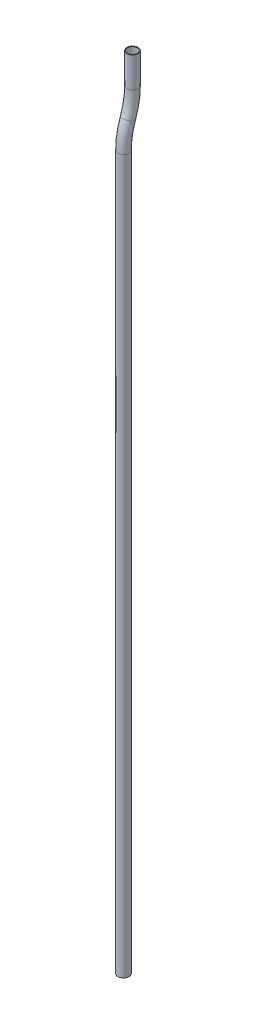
ISO-10303-21;
HEADER;
FILE_DESCRIPTION(('STEP AP214'),'2;1');
FILE_NAME('part.step','',(''),(''),'','','');
FILE_SCHEMA(('AUTOMOTIVE_DESIGN { 1 0 10303 214 1 1 1 1 }'));
ENDSEC;
DATA;
#1=APPLICATION_CONTEXT('core data for automotive mechanical design processes');
#2=APPLICATION_PROTOCOL_DEFINITION('international standard','automotive_design',2000,#1);
#3=PRODUCT_CONTEXT('',#1,'mechanical');
#4=PRODUCT('Part','Part','',(#3));
#5=PRODUCT_RELATED_PRODUCT_CATEGORY('part','',(#4));
#6=PRODUCT_DEFINITION_FORMATION('','',#4);
#7=PRODUCT_DEFINITION_CONTEXT('part definition',#1,'design');
#8=PRODUCT_DEFINITION('design','',#6,#7);
#9=PRODUCT_DEFINITION_SHAPE('','',#8);
#10=(LENGTH_UNIT() NAMED_UNIT(*) SI_UNIT(.MILLI.,.METRE.));
#11=(NAMED_UNIT(*) PLANE_ANGLE_UNIT() SI_UNIT($,.RADIAN.));
#12=(NAMED_UNIT(*) SI_UNIT($,.STERADIAN.) SOLID_ANGLE_UNIT());
#13=UNCERTAINTY_MEASURE_WITH_UNIT(LENGTH_MEASURE(1.E-05),#10,'distance_accuracy_value','');
#14=(GEOMETRIC_REPRESENTATION_CONTEXT(3) GLOBAL_UNCERTAINTY_ASSIGNED_CONTEXT((#13)) GLOBAL_UNIT_ASSIGNED_CONTEXT((#10,
#11,#12)) REPRESENTATION_CONTEXT('',''));
#15=CARTESIAN_POINT('',(0.,0.,0.));
#16=DIRECTION('',(0.,0.,1.));
#17=DIRECTION('',(1.,0.,0.));
#18=AXIS2_PLACEMENT_3D('',#15,#16,#17);
#19=CARTESIAN_POINT('',(0.,-54.6,-7.5));
#20=DIRECTION('',(0.,1.,0.));
#21=DIRECTION('',(0.,0.,1.));
#22=AXIS2_PLACEMENT_3D('',#19,#20,#21);
#23=CYLINDRICAL_SURFACE('',#22,1.6);
#24=CARTESIAN_POINT('',(0.,-54.6,-7.5));
#25=DIRECTION('',(0.,-1.,0.));
#26=DIRECTION('',(0.,0.,-1.));
#27=AXIS2_PLACEMENT_3D('',#24,#25,#26);
#28=CIRCLE('',#27,1.6);
#29=CARTESIAN_POINT('',(0.,-54.6,-5.9));
#30=VERTEX_POINT('',#29);
#31=EDGE_CURVE('E118',#30,#30,#28,.T.);
#32=ORIENTED_EDGE('',*,*,#31,.T.);
#33=DIRECTION('',(0.,1.,0.));
#34=VECTOR('',#33,1.);
#35=CARTESIAN_POINT('',(0.,-54.6,-5.9));
#36=LINE('',#35,#34);
#37=CARTESIAN_POINT('',(0.,-44.5,-5.9));
#38=VERTEX_POINT('',#37);
#39=EDGE_CURVE('E10',#30,#38,#36,.T.);
#40=ORIENTED_EDGE('',*,*,#39,.T.);
#41=CARTESIAN_POINT('',(0.,-44.5,-7.5));
#42=DIRECTION('',(0.,1.,0.));
#43=DIRECTION('',(0.,0.,1.));
#44=AXIS2_PLACEMENT_3D('',#41,#42,#43);
#45=CIRCLE('',#44,1.6);
#46=EDGE_CURVE('E27',#38,#38,#45,.T.);
#47=ORIENTED_EDGE('',*,*,#46,.T.);
#48=ORIENTED_EDGE('',*,*,#39,.F.);
#49=EDGE_LOOP('',(#32,#40,#47,#48));
#50=FACE_BOUND('',#49,.T.);
#51=ADVANCED_FACE('F16',(#50),#23,.F.);
#52=CARTESIAN_POINT('',(0.,-44.5,-7.5));
#53=DIRECTION('',(0.,1.,0.));
#54=DIRECTION('',(0.,0.,-1.));
#55=AXIS2_PLACEMENT_3D('',#52,#53,#54);
#56=PLANE('',#55);
#57=ORIENTED_EDGE('',*,*,#46,.F.);
#58=EDGE_LOOP('',(#57));
#59=FACE_BOUND('',#58,.T.);
#60=CARTESIAN_POINT('',(0.,-44.5,-7.5));
#61=DIRECTION('',(0.,1.,0.));
#62=DIRECTION('',(0.,0.,1.));
#63=AXIS2_PLACEMENT_3D('',#60,#61,#62);
#64=CIRCLE('',#63,1.85);
#65=CARTESIAN_POINT('',(0.,-44.5,-5.65));
#66=VERTEX_POINT('',#65);
#67=EDGE_CURVE('E83',#66,#66,#64,.T.);
#68=ORIENTED_EDGE('',*,*,#67,.T.);
#69=EDGE_LOOP('',(#68));
#70=FACE_BOUND('',#69,.T.);
#71=ADVANCED_FACE('F173',(#59,#70),#56,.T.);
#72=CARTESIAN_POINT('',(0.,-54.6,17.903333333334));
#73=DIRECTION('',(1.,0.,0.));
#74=DIRECTION('',(0.,-0.338538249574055,-0.940952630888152));
#75=AXIS2_PLACEMENT_3D('',#72,#73,#74);
#76=TOROIDAL_SURFACE('',#75,25.403333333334,1.6);
#77=CARTESIAN_POINT('',(0.,-63.2,-6.));
#78=DIRECTION('',(0.,-0.940952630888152,0.338538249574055));
#79=DIRECTION('',(0.,0.338538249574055,0.940952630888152));
#80=AXIS2_PLACEMENT_3D('',#77,#78,#79);
#81=CIRCLE('',#80,1.6);
#82=CARTESIAN_POINT('',(0.,-62.65833880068,-4.494475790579));
#83=VERTEX_POINT('',#82);
#84=EDGE_CURVE('E101',#83,#83,#81,.T.);
#85=ORIENTED_EDGE('',*,*,#84,.T.);
#86=CARTESIAN_POINT('',(0.,-54.6,17.903333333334));
#87=DIRECTION('',(1.,0.,0.));
#88=DIRECTION('',(0.,-0.338538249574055,-0.940952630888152));
#89=AXIS2_PLACEMENT_3D('',#86,#87,#88);
#90=CIRCLE('',#89,23.803333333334);
#91=EDGE_CURVE('E91',#83,#30,#90,.T.);
#92=ORIENTED_EDGE('',*,*,#91,.T.);
#93=ORIENTED_EDGE('',*,*,#31,.F.);
#94=ORIENTED_EDGE('',*,*,#91,.F.);
#95=EDGE_LOOP('',(#85,#92,#93,#94));
#96=FACE_BOUND('',#95,.T.);
#97=ADVANCED_FACE('F177',(#96),#76,.F.);
#98=CARTESIAN_POINT('',(0.,-54.6,-7.5));
#99=DIRECTION('',(0.,1.,0.));
#100=DIRECTION('',(0.,0.,1.));
#101=AXIS2_PLACEMENT_3D('',#98,#99,#100);
#102=CYLINDRICAL_SURFACE('',#101,1.85);
#103=DIRECTION('',(0.,1.,0.));
#104=VECTOR('',#103,1.);
#105=CARTESIAN_POINT('',(0.,-54.6,-5.65));
#106=LINE('',#105,#104);
#107=CARTESIAN_POINT('',(0.,-54.6,-5.65));
#108=VERTEX_POINT('',#107);
#109=EDGE_CURVE('E20',#108,#66,#106,.T.);
#110=ORIENTED_EDGE('',*,*,#109,.T.);
#111=ORIENTED_EDGE('',*,*,#67,.F.);
#112=ORIENTED_EDGE('',*,*,#109,.F.);
#113=CARTESIAN_POINT('',(0.,-54.6,-7.5));
#114=DIRECTION('',(0.,-1.,0.));
#115=DIRECTION('',(0.,0.,-1.));
#116=AXIS2_PLACEMENT_3D('',#113,#114,#115);
#117=CIRCLE('',#116,1.85);
#118=EDGE_CURVE('E99',#108,#108,#117,.T.);
#119=ORIENTED_EDGE('',*,*,#118,.F.);
#120=EDGE_LOOP('',(#110,#111,#112,#119));
#121=FACE_BOUND('',#120,.T.);
#122=ADVANCED_FACE('F98',(#121),#102,.T.);
#123=CARTESIAN_POINT('',(0.,-71.8,-29.90333333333));
#124=DIRECTION('',(-1.,0.,0.));
#125=DIRECTION('',(0.,0.,1.));
#126=AXIS2_PLACEMENT_3D('',#123,#124,#125);
#127=TOROIDAL_SURFACE('',#126,25.403333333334,1.6);
#128=CARTESIAN_POINT('',(0.,-71.8,-4.5));
#129=DIRECTION('',(0.,1.,0.));
#130=DIRECTION('',(0.,0.,1.));
#131=AXIS2_PLACEMENT_3D('',#128,#129,#130);
#132=CIRCLE('',#131,1.6);
#133=CARTESIAN_POINT('',(0.,-71.8,-2.9));
#134=VERTEX_POINT('',#133);
#135=EDGE_CURVE('E113',#134,#134,#132,.T.);
#136=ORIENTED_EDGE('',*,*,#135,.F.);
#137=CARTESIAN_POINT('',(0.,-71.8,-29.90333333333));
#138=DIRECTION('',(-1.,0.,0.));
#139=DIRECTION('',(0.,0.,1.));
#140=AXIS2_PLACEMENT_3D('',#137,#138,#139);
#141=CIRCLE('',#140,27.003333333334);
#142=EDGE_CURVE('E104',#134,#83,#141,.T.);
#143=ORIENTED_EDGE('',*,*,#142,.T.);
#144=ORIENTED_EDGE('',*,*,#84,.F.);
#145=ORIENTED_EDGE('',*,*,#142,.F.);
#146=EDGE_LOOP('',(#136,#143,#144,#145));
#147=FACE_BOUND('',#146,.T.);
#148=ADVANCED_FACE('F184',(#147),#127,.F.);
#149=CARTESIAN_POINT('',(0.,-54.6,17.903333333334));
#150=DIRECTION('',(1.,0.,0.));
#151=DIRECTION('',(0.,-0.338538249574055,-0.940952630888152));
#152=AXIS2_PLACEMENT_3D('',#149,#150,#151);
#153=TOROIDAL_SURFACE('',#152,25.403333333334,1.85);
#154=CARTESIAN_POINT('',(0.,-54.6,17.903333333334));
#155=DIRECTION('',(1.,0.,0.));
#156=DIRECTION('',(0.,-0.338538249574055,-0.940952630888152));
#157=AXIS2_PLACEMENT_3D('',#154,#155,#156);
#158=CIRCLE('',#157,23.553333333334);
#159=CARTESIAN_POINT('',(0.,-62.57370423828,-4.259237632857));
#160=VERTEX_POINT('',#159);
#161=EDGE_CURVE('E64',#160,#108,#158,.T.);
#162=ORIENTED_EDGE('',*,*,#161,.T.);
#163=ORIENTED_EDGE('',*,*,#118,.T.);
#164=ORIENTED_EDGE('',*,*,#161,.F.);
#165=CARTESIAN_POINT('',(0.,-63.2,-6.));
#166=DIRECTION('',(0.,-0.940952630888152,0.338538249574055));
#167=DIRECTION('',(0.,0.338538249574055,0.940952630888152));
#168=AXIS2_PLACEMENT_3D('',#165,#166,#167);
#169=CIRCLE('',#168,1.85);
#170=EDGE_CURVE('E146',#160,#160,#169,.T.);
#171=ORIENTED_EDGE('',*,*,#170,.F.);
#172=EDGE_LOOP('',(#162,#163,#164,#171));
#173=FACE_BOUND('',#172,.T.);
#174=ADVANCED_FACE('F102',(#173),#153,.T.);
#175=CARTESIAN_POINT('',(0.,-310.,-4.5));
#176=DIRECTION('',(0.,1.,0.));
#177=DIRECTION('',(0.,0.,1.));
#178=AXIS2_PLACEMENT_3D('',#175,#176,#177);
#179=CYLINDRICAL_SURFACE('',#178,1.6);
#180=CARTESIAN_POINT('',(0.,-310.,-4.5));
#181=DIRECTION('',(0.,1.,0.));
#182=DIRECTION('',(0.,0.,1.));
#183=AXIS2_PLACEMENT_3D('',#180,#181,#182);
#184=CIRCLE('',#183,1.6);
#185=CARTESIAN_POINT('',(0.,-310.,-2.9));
#186=VERTEX_POINT('',#185);
#187=EDGE_CURVE('E132',#186,#186,#184,.T.);
#188=ORIENTED_EDGE('',*,*,#187,.F.);
#189=DIRECTION('',(0.,1.,0.));
#190=VECTOR('',#189,1.);
#191=CARTESIAN_POINT('',(0.,-310.,-2.9));
#192=LINE('',#191,#190);
#193=EDGE_CURVE('E75',#186,#134,#192,.T.);
#194=ORIENTED_EDGE('',*,*,#193,.T.);
#195=ORIENTED_EDGE('',*,*,#135,.T.);
#196=ORIENTED_EDGE('',*,*,#193,.F.);
#197=EDGE_LOOP('',(#188,#194,#195,#196));
#198=FACE_BOUND('',#197,.T.);
#199=ADVANCED_FACE('F183',(#198),#179,.F.);
#200=CARTESIAN_POINT('',(0.,-71.8,-29.90333333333));
#201=DIRECTION('',(-1.,0.,0.));
#202=DIRECTION('',(0.,0.,1.));
#203=AXIS2_PLACEMENT_3D('',#200,#201,#202);
#204=TOROIDAL_SURFACE('',#203,25.403333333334,1.85);
#205=CARTESIAN_POINT('',(0.,-71.8,-29.90333333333));
#206=DIRECTION('',(-1.,0.,0.));
#207=DIRECTION('',(0.,0.,1.));
#208=AXIS2_PLACEMENT_3D('',#205,#206,#207);
#209=CIRCLE('',#208,27.253333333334);
#210=CARTESIAN_POINT('',(0.,-71.8,-2.65));
#211=VERTEX_POINT('',#210);
#212=EDGE_CURVE('E138',#211,#160,#209,.T.);
#213=ORIENTED_EDGE('',*,*,#212,.T.);
#214=ORIENTED_EDGE('',*,*,#170,.T.);
#215=ORIENTED_EDGE('',*,*,#212,.F.);
#216=CARTESIAN_POINT('',(0.,-71.8,-4.5));
#217=DIRECTION('',(0.,1.,0.));
#218=DIRECTION('',(0.,0.,1.));
#219=AXIS2_PLACEMENT_3D('',#216,#217,#218);
#220=CIRCLE('',#219,1.85);
#221=EDGE_CURVE('E126',#211,#211,#220,.T.);
#222=ORIENTED_EDGE('',*,*,#221,.T.);
#223=EDGE_LOOP('',(#213,#214,#215,#222));
#224=FACE_BOUND('',#223,.T.);
#225=ADVANCED_FACE('F18',(#224),#204,.T.);
#226=CARTESIAN_POINT('',(0.,-310.,-4.5));
#227=DIRECTION('',(0.,1.,0.));
#228=DIRECTION('',(0.,0.,-1.));
#229=AXIS2_PLACEMENT_3D('',#226,#227,#228);
#230=PLANE('',#229);
#231=ORIENTED_EDGE('',*,*,#187,.T.);
#232=EDGE_LOOP('',(#231));
#233=FACE_BOUND('',#232,.T.);
#234=CARTESIAN_POINT('',(0.,-310.,-4.5));
#235=DIRECTION('',(0.,1.,0.));
#236=DIRECTION('',(0.,0.,1.));
#237=AXIS2_PLACEMENT_3D('',#234,#235,#236);
#238=CIRCLE('',#237,1.85);
#239=CARTESIAN_POINT('',(0.,-310.,-2.65));
#240=VERTEX_POINT('',#239);
#241=EDGE_CURVE('E129',#240,#240,#238,.T.);
#242=ORIENTED_EDGE('',*,*,#241,.F.);
#243=EDGE_LOOP('',(#242));
#244=FACE_BOUND('',#243,.T.);
#245=ADVANCED_FACE('F163',(#233,#244),#230,.F.);
#246=CARTESIAN_POINT('',(0.,-310.,-4.5));
#247=DIRECTION('',(0.,1.,0.));
#248=DIRECTION('',(0.,0.,1.));
#249=AXIS2_PLACEMENT_3D('',#246,#247,#248);
#250=CYLINDRICAL_SURFACE('',#249,1.85);
#251=DIRECTION('',(0.,1.,0.));
#252=VECTOR('',#251,1.);
#253=CARTESIAN_POINT('',(0.,-310.,-2.65));
#254=LINE('',#253,#252);
#255=EDGE_CURVE('E122',#240,#211,#254,.T.);
#256=ORIENTED_EDGE('',*,*,#255,.T.);
#257=ORIENTED_EDGE('',*,*,#221,.F.);
#258=ORIENTED_EDGE('',*,*,#255,.F.);
#259=ORIENTED_EDGE('',*,*,#241,.T.);
#260=EDGE_LOOP('',(#256,#257,#258,#259));
#261=FACE_BOUND('',#260,.T.);
#262=ADVANCED_FACE('F158',(#261),#250,.T.);
#263=CLOSED_SHELL('',(#51,#71,#97,#122,#148,#174,#199,#225,#245,#262));
#264=MANIFOLD_SOLID_BREP('B1',#263);
#265=ADVANCED_BREP_SHAPE_REPRESENTATION('',(#18,#264),#14);
#266=SHAPE_DEFINITION_REPRESENTATION(#9,#265);
ENDSEC;
END-ISO-10303-21;
